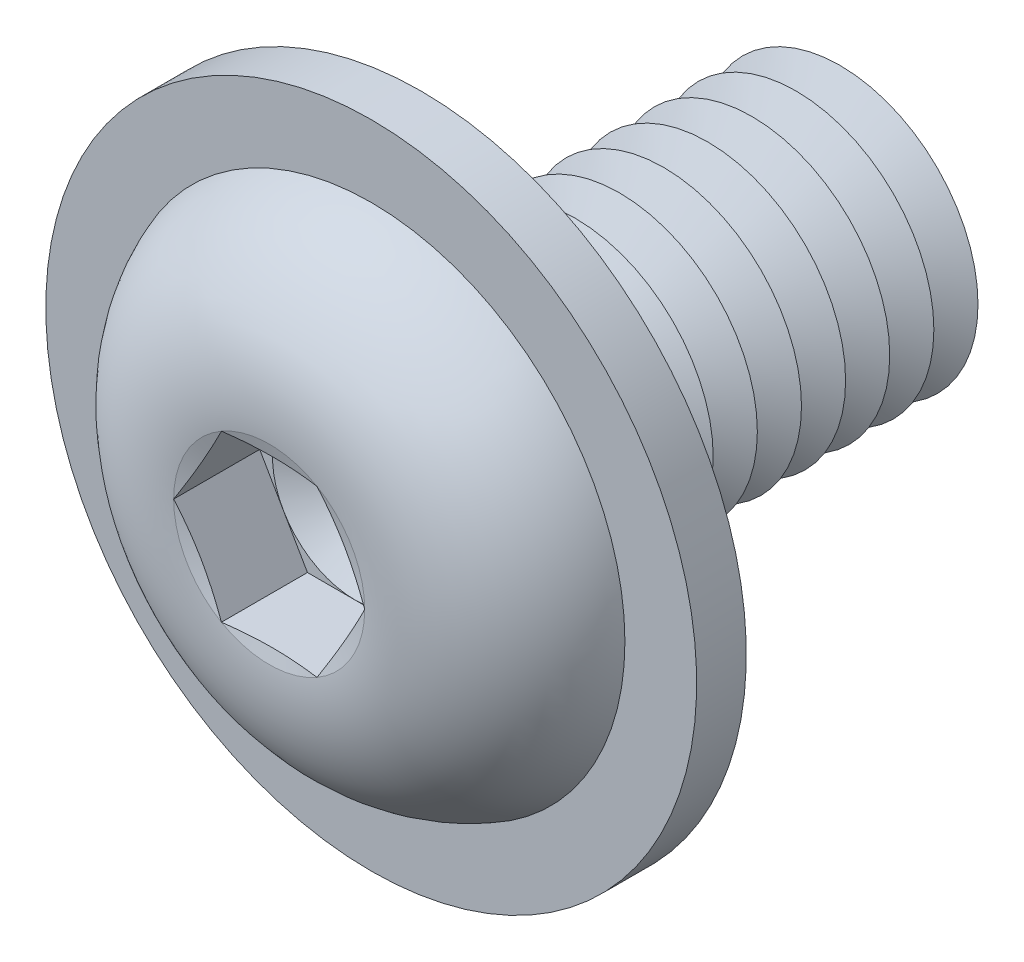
ISO-10303-21;
HEADER;
FILE_DESCRIPTION(('STEP AP214'),'2;1');
FILE_NAME('part.step','',(''),(''),'','','');
FILE_SCHEMA(('AUTOMOTIVE_DESIGN { 1 0 10303 214 1 1 1 1 }'));
ENDSEC;
DATA;
#1=APPLICATION_CONTEXT('core data for automotive mechanical design processes');
#2=APPLICATION_PROTOCOL_DEFINITION('international standard','automotive_design',2000,#1);
#3=PRODUCT_CONTEXT('',#1,'mechanical');
#4=PRODUCT('Part','Part','',(#3));
#5=PRODUCT_RELATED_PRODUCT_CATEGORY('part','',(#4));
#6=PRODUCT_DEFINITION_FORMATION('','',#4);
#7=PRODUCT_DEFINITION_CONTEXT('part definition',#1,'design');
#8=PRODUCT_DEFINITION('design','',#6,#7);
#9=PRODUCT_DEFINITION_SHAPE('','',#8);
#10=(LENGTH_UNIT() NAMED_UNIT(*) SI_UNIT(.MILLI.,.METRE.));
#11=(NAMED_UNIT(*) PLANE_ANGLE_UNIT() SI_UNIT($,.RADIAN.));
#12=(NAMED_UNIT(*) SI_UNIT($,.STERADIAN.) SOLID_ANGLE_UNIT());
#13=UNCERTAINTY_MEASURE_WITH_UNIT(LENGTH_MEASURE(1.E-05),#10,'distance_accuracy_value','');
#14=(GEOMETRIC_REPRESENTATION_CONTEXT(3) GLOBAL_UNCERTAINTY_ASSIGNED_CONTEXT((#13)) GLOBAL_UNIT_ASSIGNED_CONTEXT((#10,
#11,#12)) REPRESENTATION_CONTEXT('',''));
#15=CARTESIAN_POINT('',(0.,0.,0.));
#16=DIRECTION('',(0.,0.,1.));
#17=DIRECTION('',(1.,0.,0.));
#18=AXIS2_PLACEMENT_3D('',#15,#16,#17);
#19=CARTESIAN_POINT('',(0.,0.,-5.2));
#20=DIRECTION('',(0.,0.,1.));
#21=DIRECTION('',(1.,0.,0.));
#22=AXIS2_PLACEMENT_3D('',#19,#20,#21);
#23=CONICAL_SURFACE('',#22,2.5,1.0471975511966);
#24=CARTESIAN_POINT('',(0.,0.,-5.6));
#25=DIRECTION('',(0.,0.,1.));
#26=DIRECTION('',(1.,0.,0.));
#27=AXIS2_PLACEMENT_3D('',#24,#25,#26);
#28=CIRCLE('',#27,1.80717967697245);
#29=CARTESIAN_POINT('',(1.80717967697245,0.,-5.6));
#30=VERTEX_POINT('',#29);
#31=EDGE_CURVE('E291',#30,#30,#28,.T.);
#32=ORIENTED_EDGE('',*,*,#31,.T.);
#33=EDGE_LOOP('',(#32));
#34=FACE_BOUND('',#33,.T.);
#35=CARTESIAN_POINT('',(0.,0.,-5.2));
#36=DIRECTION('',(0.,0.,1.));
#37=DIRECTION('',(1.,0.,0.));
#38=AXIS2_PLACEMENT_3D('',#35,#36,#37);
#39=CIRCLE('',#38,2.50000000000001);
#40=CARTESIAN_POINT('',(2.50000000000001,0.,-5.2));
#41=VERTEX_POINT('',#40);
#42=EDGE_CURVE('E287',#41,#41,#39,.T.);
#43=ORIENTED_EDGE('',*,*,#42,.F.);
#44=EDGE_LOOP('',(#43));
#45=FACE_BOUND('',#44,.T.);
#46=ADVANCED_FACE('F39',(#34,#45),#23,.T.);
#47=CARTESIAN_POINT('',(0.,0.,-5.6));
#48=DIRECTION('',(0.,0.,-1.));
#49=DIRECTION('',(-1.,0.,0.));
#50=AXIS2_PLACEMENT_3D('',#47,#48,#49);
#51=CONICAL_SURFACE('',#50,1.80717967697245,1.0471975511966);
#52=CARTESIAN_POINT('',(0.,0.,-6.));
#53=DIRECTION('',(0.,0.,1.));
#54=DIRECTION('',(1.,0.,0.));
#55=AXIS2_PLACEMENT_3D('',#52,#53,#54);
#56=CIRCLE('',#55,2.50000000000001);
#57=CARTESIAN_POINT('',(2.50000000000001,0.,-6.));
#58=VERTEX_POINT('',#57);
#59=EDGE_CURVE('E295',#58,#58,#56,.T.);
#60=ORIENTED_EDGE('',*,*,#59,.T.);
#61=EDGE_LOOP('',(#60));
#62=FACE_BOUND('',#61,.T.);
#63=ORIENTED_EDGE('',*,*,#31,.F.);
#64=EDGE_LOOP('',(#63));
#65=FACE_BOUND('',#64,.T.);
#66=ADVANCED_FACE('F406',(#62,#65),#51,.T.);
#67=CARTESIAN_POINT('',(0.,2.5,-8.));
#68=DIRECTION('',(0.,0.,-1.));
#69=DIRECTION('',(-1.,0.,0.));
#70=AXIS2_PLACEMENT_3D('',#67,#68,#69);
#71=PLANE('',#70);
#72=CARTESIAN_POINT('',(0.,0.,-8.));
#73=DIRECTION('',(0.,0.,1.));
#74=DIRECTION('',(1.,0.,0.));
#75=AXIS2_PLACEMENT_3D('',#72,#73,#74);
#76=CIRCLE('',#75,1.80717967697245);
#77=CARTESIAN_POINT('',(1.80717967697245,0.,-8.));
#78=VERTEX_POINT('',#77);
#79=EDGE_CURVE('E315',#78,#78,#76,.T.);
#80=ORIENTED_EDGE('',*,*,#79,.F.);
#81=EDGE_LOOP('',(#80));
#82=FACE_BOUND('',#81,.T.);
#83=ADVANCED_FACE('F412',(#82),#71,.T.);
#84=CARTESIAN_POINT('',(0.,0.,-7.6));
#85=DIRECTION('',(0.,0.,1.));
#86=DIRECTION('',(1.,0.,0.));
#87=AXIS2_PLACEMENT_3D('',#84,#85,#86);
#88=CONICAL_SURFACE('',#87,2.5,1.0471975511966);
#89=ORIENTED_EDGE('',*,*,#79,.T.);
#90=EDGE_LOOP('',(#89));
#91=FACE_BOUND('',#90,.T.);
#92=CARTESIAN_POINT('',(0.,0.,-7.6));
#93=DIRECTION('',(0.,0.,1.));
#94=DIRECTION('',(1.,0.,0.));
#95=AXIS2_PLACEMENT_3D('',#92,#93,#94);
#96=CIRCLE('',#95,2.50000000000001);
#97=CARTESIAN_POINT('',(2.50000000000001,0.,-7.6));
#98=VERTEX_POINT('',#97);
#99=EDGE_CURVE('E311',#98,#98,#96,.T.);
#100=ORIENTED_EDGE('',*,*,#99,.F.);
#101=EDGE_LOOP('',(#100));
#102=FACE_BOUND('',#101,.T.);
#103=ADVANCED_FACE('F431',(#91,#102),#88,.T.);
#104=CARTESIAN_POINT('',(0.,0.,-7.2));
#105=DIRECTION('',(0.,0.,-1.));
#106=DIRECTION('',(-1.,0.,0.));
#107=AXIS2_PLACEMENT_3D('',#104,#105,#106);
#108=CONICAL_SURFACE('',#107,1.80717967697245,1.0471975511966);
#109=ORIENTED_EDGE('',*,*,#99,.T.);
#110=EDGE_LOOP('',(#109));
#111=FACE_BOUND('',#110,.T.);
#112=CARTESIAN_POINT('',(0.,0.,-7.2));
#113=DIRECTION('',(0.,0.,1.));
#114=DIRECTION('',(1.,0.,0.));
#115=AXIS2_PLACEMENT_3D('',#112,#113,#114);
#116=CIRCLE('',#115,1.80717967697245);
#117=CARTESIAN_POINT('',(1.80717967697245,0.,-7.2));
#118=VERTEX_POINT('',#117);
#119=EDGE_CURVE('E307',#118,#118,#116,.T.);
#120=ORIENTED_EDGE('',*,*,#119,.F.);
#121=EDGE_LOOP('',(#120));
#122=FACE_BOUND('',#121,.T.);
#123=ADVANCED_FACE('F428',(#111,#122),#108,.T.);
#124=CARTESIAN_POINT('',(0.,0.,-6.8));
#125=DIRECTION('',(0.,0.,1.));
#126=DIRECTION('',(1.,0.,0.));
#127=AXIS2_PLACEMENT_3D('',#124,#125,#126);
#128=CONICAL_SURFACE('',#127,2.5,1.0471975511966);
#129=ORIENTED_EDGE('',*,*,#119,.T.);
#130=EDGE_LOOP('',(#129));
#131=FACE_BOUND('',#130,.T.);
#132=CARTESIAN_POINT('',(0.,0.,-6.8));
#133=DIRECTION('',(0.,0.,1.));
#134=DIRECTION('',(1.,0.,0.));
#135=AXIS2_PLACEMENT_3D('',#132,#133,#134);
#136=CIRCLE('',#135,2.50000000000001);
#137=CARTESIAN_POINT('',(2.50000000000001,0.,-6.8));
#138=VERTEX_POINT('',#137);
#139=EDGE_CURVE('E303',#138,#138,#136,.T.);
#140=ORIENTED_EDGE('',*,*,#139,.F.);
#141=EDGE_LOOP('',(#140));
#142=FACE_BOUND('',#141,.T.);
#143=ADVANCED_FACE('F422',(#131,#142),#128,.T.);
#144=CARTESIAN_POINT('',(0.,0.,-6.4));
#145=DIRECTION('',(0.,0.,-1.));
#146=DIRECTION('',(-1.,0.,0.));
#147=AXIS2_PLACEMENT_3D('',#144,#145,#146);
#148=CONICAL_SURFACE('',#147,1.80717967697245,1.0471975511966);
#149=ORIENTED_EDGE('',*,*,#139,.T.);
#150=EDGE_LOOP('',(#149));
#151=FACE_BOUND('',#150,.T.);
#152=CARTESIAN_POINT('',(0.,0.,-6.4));
#153=DIRECTION('',(0.,0.,1.));
#154=DIRECTION('',(1.,0.,0.));
#155=AXIS2_PLACEMENT_3D('',#152,#153,#154);
#156=CIRCLE('',#155,1.80717967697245);
#157=CARTESIAN_POINT('',(1.80717967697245,0.,-6.4));
#158=VERTEX_POINT('',#157);
#159=EDGE_CURVE('E299',#158,#158,#156,.T.);
#160=ORIENTED_EDGE('',*,*,#159,.F.);
#161=EDGE_LOOP('',(#160));
#162=FACE_BOUND('',#161,.T.);
#163=ADVANCED_FACE('F418',(#151,#162),#148,.T.);
#164=CARTESIAN_POINT('',(0.,0.,-6.));
#165=DIRECTION('',(0.,0.,1.));
#166=DIRECTION('',(1.,0.,0.));
#167=AXIS2_PLACEMENT_3D('',#164,#165,#166);
#168=CONICAL_SURFACE('',#167,2.5,1.0471975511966);
#169=ORIENTED_EDGE('',*,*,#159,.T.);
#170=EDGE_LOOP('',(#169));
#171=FACE_BOUND('',#170,.T.);
#172=ORIENTED_EDGE('',*,*,#59,.F.);
#173=EDGE_LOOP('',(#172));
#174=FACE_BOUND('',#173,.T.);
#175=ADVANCED_FACE('F421',(#171,#174),#168,.T.);
#176=CARTESIAN_POINT('',(0.,0.,-4.4));
#177=DIRECTION('',(0.,0.,1.));
#178=DIRECTION('',(1.,0.,0.));
#179=AXIS2_PLACEMENT_3D('',#176,#177,#178);
#180=CONICAL_SURFACE('',#179,2.5,1.0471975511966);
#181=CARTESIAN_POINT('',(0.,0.,-4.8));
#182=DIRECTION('',(0.,0.,1.));
#183=DIRECTION('',(1.,0.,0.));
#184=AXIS2_PLACEMENT_3D('',#181,#182,#183);
#185=CIRCLE('',#184,1.80717967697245);
#186=CARTESIAN_POINT('',(1.80717967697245,0.,-4.8));
#187=VERTEX_POINT('',#186);
#188=EDGE_CURVE('E283',#187,#187,#185,.T.);
#189=ORIENTED_EDGE('',*,*,#188,.T.);
#190=EDGE_LOOP('',(#189));
#191=FACE_BOUND('',#190,.T.);
#192=CARTESIAN_POINT('',(0.,0.,-4.4));
#193=DIRECTION('',(0.,0.,1.));
#194=DIRECTION('',(1.,0.,0.));
#195=AXIS2_PLACEMENT_3D('',#192,#193,#194);
#196=CIRCLE('',#195,2.50000000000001);
#197=CARTESIAN_POINT('',(2.50000000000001,0.,-4.4));
#198=VERTEX_POINT('',#197);
#199=EDGE_CURVE('E279',#198,#198,#196,.T.);
#200=ORIENTED_EDGE('',*,*,#199,.F.);
#201=EDGE_LOOP('',(#200));
#202=FACE_BOUND('',#201,.T.);
#203=ADVANCED_FACE('F426',(#191,#202),#180,.T.);
#204=CARTESIAN_POINT('',(0.,0.,-4.8));
#205=DIRECTION('',(0.,0.,-1.));
#206=DIRECTION('',(-1.,0.,0.));
#207=AXIS2_PLACEMENT_3D('',#204,#205,#206);
#208=CONICAL_SURFACE('',#207,1.80717967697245,1.0471975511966);
#209=ORIENTED_EDGE('',*,*,#42,.T.);
#210=EDGE_LOOP('',(#209));
#211=FACE_BOUND('',#210,.T.);
#212=ORIENTED_EDGE('',*,*,#188,.F.);
#213=EDGE_LOOP('',(#212));
#214=FACE_BOUND('',#213,.T.);
#215=ADVANCED_FACE('F477',(#211,#214),#208,.T.);
#216=CARTESIAN_POINT('',(0.,0.,-3.6));
#217=DIRECTION('',(0.,0.,1.));
#218=DIRECTION('',(1.,0.,0.));
#219=AXIS2_PLACEMENT_3D('',#216,#217,#218);
#220=CONICAL_SURFACE('',#219,2.5,1.0471975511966);
#221=CARTESIAN_POINT('',(0.,0.,-4.));
#222=DIRECTION('',(0.,0.,1.));
#223=DIRECTION('',(1.,0.,0.));
#224=AXIS2_PLACEMENT_3D('',#221,#222,#223);
#225=CIRCLE('',#224,1.80717967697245);
#226=CARTESIAN_POINT('',(1.80717967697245,0.,-4.));
#227=VERTEX_POINT('',#226);
#228=EDGE_CURVE('E275',#227,#227,#225,.T.);
#229=ORIENTED_EDGE('',*,*,#228,.T.);
#230=EDGE_LOOP('',(#229));
#231=FACE_BOUND('',#230,.T.);
#232=CARTESIAN_POINT('',(0.,0.,-3.6));
#233=DIRECTION('',(0.,0.,1.));
#234=DIRECTION('',(1.,0.,0.));
#235=AXIS2_PLACEMENT_3D('',#232,#233,#234);
#236=CIRCLE('',#235,2.50000000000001);
#237=CARTESIAN_POINT('',(2.50000000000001,0.,-3.6));
#238=VERTEX_POINT('',#237);
#239=EDGE_CURVE('E271',#238,#238,#236,.T.);
#240=ORIENTED_EDGE('',*,*,#239,.F.);
#241=EDGE_LOOP('',(#240));
#242=FACE_BOUND('',#241,.T.);
#243=ADVANCED_FACE('F483',(#231,#242),#220,.T.);
#244=CARTESIAN_POINT('',(0.,0.,-4.));
#245=DIRECTION('',(0.,0.,-1.));
#246=DIRECTION('',(-1.,0.,0.));
#247=AXIS2_PLACEMENT_3D('',#244,#245,#246);
#248=CONICAL_SURFACE('',#247,1.80717967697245,1.0471975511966);
#249=ORIENTED_EDGE('',*,*,#199,.T.);
#250=EDGE_LOOP('',(#249));
#251=FACE_BOUND('',#250,.T.);
#252=ORIENTED_EDGE('',*,*,#228,.F.);
#253=EDGE_LOOP('',(#252));
#254=FACE_BOUND('',#253,.T.);
#255=ADVANCED_FACE('F490',(#251,#254),#248,.T.);
#256=CARTESIAN_POINT('',(0.,0.,-2.8));
#257=DIRECTION('',(0.,0.,1.));
#258=DIRECTION('',(1.,0.,0.));
#259=AXIS2_PLACEMENT_3D('',#256,#257,#258);
#260=CONICAL_SURFACE('',#259,2.5,1.0471975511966);
#261=CARTESIAN_POINT('',(0.,0.,-3.2));
#262=DIRECTION('',(0.,0.,1.));
#263=DIRECTION('',(1.,0.,0.));
#264=AXIS2_PLACEMENT_3D('',#261,#262,#263);
#265=CIRCLE('',#264,1.80717967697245);
#266=CARTESIAN_POINT('',(1.80717967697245,0.,-3.2));
#267=VERTEX_POINT('',#266);
#268=EDGE_CURVE('E267',#267,#267,#265,.T.);
#269=ORIENTED_EDGE('',*,*,#268,.T.);
#270=EDGE_LOOP('',(#269));
#271=FACE_BOUND('',#270,.T.);
#272=CARTESIAN_POINT('',(0.,0.,-2.8));
#273=DIRECTION('',(0.,0.,1.));
#274=DIRECTION('',(1.,0.,0.));
#275=AXIS2_PLACEMENT_3D('',#272,#273,#274);
#276=CIRCLE('',#275,2.50000000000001);
#277=CARTESIAN_POINT('',(2.50000000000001,0.,-2.8));
#278=VERTEX_POINT('',#277);
#279=EDGE_CURVE('E263',#278,#278,#276,.T.);
#280=ORIENTED_EDGE('',*,*,#279,.F.);
#281=EDGE_LOOP('',(#280));
#282=FACE_BOUND('',#281,.T.);
#283=ADVANCED_FACE('F497',(#271,#282),#260,.T.);
#284=CARTESIAN_POINT('',(0.,0.,-3.2));
#285=DIRECTION('',(0.,0.,-1.));
#286=DIRECTION('',(-1.,0.,0.));
#287=AXIS2_PLACEMENT_3D('',#284,#285,#286);
#288=CONICAL_SURFACE('',#287,1.80717967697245,1.0471975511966);
#289=ORIENTED_EDGE('',*,*,#239,.T.);
#290=EDGE_LOOP('',(#289));
#291=FACE_BOUND('',#290,.T.);
#292=ORIENTED_EDGE('',*,*,#268,.F.);
#293=EDGE_LOOP('',(#292));
#294=FACE_BOUND('',#293,.T.);
#295=ADVANCED_FACE('F504',(#291,#294),#288,.T.);
#296=CARTESIAN_POINT('',(0.,0.,-2.));
#297=DIRECTION('',(0.,0.,1.));
#298=DIRECTION('',(1.,0.,0.));
#299=AXIS2_PLACEMENT_3D('',#296,#297,#298);
#300=CONICAL_SURFACE('',#299,2.5,1.0471975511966);
#301=CARTESIAN_POINT('',(0.,0.,-2.4));
#302=DIRECTION('',(0.,0.,1.));
#303=DIRECTION('',(1.,0.,0.));
#304=AXIS2_PLACEMENT_3D('',#301,#302,#303);
#305=CIRCLE('',#304,1.80717967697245);
#306=CARTESIAN_POINT('',(1.80717967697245,0.,-2.4));
#307=VERTEX_POINT('',#306);
#308=EDGE_CURVE('E259',#307,#307,#305,.T.);
#309=ORIENTED_EDGE('',*,*,#308,.T.);
#310=EDGE_LOOP('',(#309));
#311=FACE_BOUND('',#310,.T.);
#312=CARTESIAN_POINT('',(0.,0.,-2.));
#313=DIRECTION('',(0.,0.,1.));
#314=DIRECTION('',(1.,0.,0.));
#315=AXIS2_PLACEMENT_3D('',#312,#313,#314);
#316=CIRCLE('',#315,2.50000000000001);
#317=CARTESIAN_POINT('',(2.50000000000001,0.,-2.));
#318=VERTEX_POINT('',#317);
#319=EDGE_CURVE('E255',#318,#318,#316,.T.);
#320=ORIENTED_EDGE('',*,*,#319,.F.);
#321=EDGE_LOOP('',(#320));
#322=FACE_BOUND('',#321,.T.);
#323=ADVANCED_FACE('F511',(#311,#322),#300,.T.);
#324=CARTESIAN_POINT('',(0.,0.,-2.4));
#325=DIRECTION('',(0.,0.,-1.));
#326=DIRECTION('',(-1.,0.,0.));
#327=AXIS2_PLACEMENT_3D('',#324,#325,#326);
#328=CONICAL_SURFACE('',#327,1.80717967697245,1.0471975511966);
#329=ORIENTED_EDGE('',*,*,#279,.T.);
#330=EDGE_LOOP('',(#329));
#331=FACE_BOUND('',#330,.T.);
#332=ORIENTED_EDGE('',*,*,#308,.F.);
#333=EDGE_LOOP('',(#332));
#334=FACE_BOUND('',#333,.T.);
#335=ADVANCED_FACE('F518',(#331,#334),#328,.T.);
#336=CARTESIAN_POINT('',(0.,0.,-1.2));
#337=DIRECTION('',(0.,0.,1.));
#338=DIRECTION('',(1.,0.,0.));
#339=AXIS2_PLACEMENT_3D('',#336,#337,#338);
#340=CONICAL_SURFACE('',#339,2.5,1.0471975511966);
#341=CARTESIAN_POINT('',(0.,0.,-1.6));
#342=DIRECTION('',(0.,0.,1.));
#343=DIRECTION('',(1.,0.,0.));
#344=AXIS2_PLACEMENT_3D('',#341,#342,#343);
#345=CIRCLE('',#344,1.80717967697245);
#346=CARTESIAN_POINT('',(1.80717967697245,0.,-1.6));
#347=VERTEX_POINT('',#346);
#348=EDGE_CURVE('E251',#347,#347,#345,.T.);
#349=ORIENTED_EDGE('',*,*,#348,.T.);
#350=EDGE_LOOP('',(#349));
#351=FACE_BOUND('',#350,.T.);
#352=CARTESIAN_POINT('',(0.,0.,-1.2));
#353=DIRECTION('',(0.,0.,1.));
#354=DIRECTION('',(1.,0.,0.));
#355=AXIS2_PLACEMENT_3D('',#352,#353,#354);
#356=CIRCLE('',#355,2.50000000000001);
#357=CARTESIAN_POINT('',(2.50000000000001,0.,-1.2));
#358=VERTEX_POINT('',#357);
#359=EDGE_CURVE('E243',#358,#358,#356,.T.);
#360=ORIENTED_EDGE('',*,*,#359,.F.);
#361=EDGE_LOOP('',(#360));
#362=FACE_BOUND('',#361,.T.);
#363=ADVANCED_FACE('F525',(#351,#362),#340,.T.);
#364=CARTESIAN_POINT('',(0.,0.,-1.6));
#365=DIRECTION('',(0.,0.,-1.));
#366=DIRECTION('',(-1.,0.,0.));
#367=AXIS2_PLACEMENT_3D('',#364,#365,#366);
#368=CONICAL_SURFACE('',#367,1.80717967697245,1.0471975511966);
#369=ORIENTED_EDGE('',*,*,#319,.T.);
#370=EDGE_LOOP('',(#369));
#371=FACE_BOUND('',#370,.T.);
#372=ORIENTED_EDGE('',*,*,#348,.F.);
#373=EDGE_LOOP('',(#372));
#374=FACE_BOUND('',#373,.T.);
#375=ADVANCED_FACE('F532',(#371,#374),#368,.T.);
#376=CARTESIAN_POINT('',(0.,0.,-0.399999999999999));
#377=DIRECTION('',(0.,0.,1.));
#378=DIRECTION('',(1.,0.,0.));
#379=AXIS2_PLACEMENT_3D('',#376,#377,#378);
#380=CONICAL_SURFACE('',#379,2.5,1.0471975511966);
#381=CARTESIAN_POINT('',(0.,0.,-0.799999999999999));
#382=DIRECTION('',(0.,0.,1.));
#383=DIRECTION('',(1.,0.,0.));
#384=AXIS2_PLACEMENT_3D('',#381,#382,#383);
#385=CIRCLE('',#384,1.80717967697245);
#386=CARTESIAN_POINT('',(1.80717967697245,0.,-0.799999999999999));
#387=VERTEX_POINT('',#386);
#388=EDGE_CURVE('E232',#387,#387,#385,.T.);
#389=ORIENTED_EDGE('',*,*,#388,.T.);
#390=EDGE_LOOP('',(#389));
#391=FACE_BOUND('',#390,.T.);
#392=CARTESIAN_POINT('',(0.,0.,-0.399999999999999));
#393=DIRECTION('',(0.,0.,1.));
#394=DIRECTION('',(1.,0.,0.));
#395=AXIS2_PLACEMENT_3D('',#392,#393,#394);
#396=CIRCLE('',#395,2.5);
#397=CARTESIAN_POINT('',(2.5,0.,-0.399999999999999));
#398=VERTEX_POINT('',#397);
#399=EDGE_CURVE('E247',#398,#398,#396,.T.);
#400=ORIENTED_EDGE('',*,*,#399,.F.);
#401=EDGE_LOOP('',(#400));
#402=FACE_BOUND('',#401,.T.);
#403=ADVANCED_FACE('F539',(#391,#402),#380,.T.);
#404=CARTESIAN_POINT('',(0.,0.,-0.799999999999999));
#405=DIRECTION('',(0.,0.,-1.));
#406=DIRECTION('',(-1.,0.,0.));
#407=AXIS2_PLACEMENT_3D('',#404,#405,#406);
#408=CONICAL_SURFACE('',#407,1.80717967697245,1.0471975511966);
#409=ORIENTED_EDGE('',*,*,#359,.T.);
#410=EDGE_LOOP('',(#409));
#411=FACE_BOUND('',#410,.T.);
#412=ORIENTED_EDGE('',*,*,#388,.F.);
#413=EDGE_LOOP('',(#412));
#414=FACE_BOUND('',#413,.T.);
#415=ADVANCED_FACE('F221',(#411,#414),#408,.T.);
#416=CARTESIAN_POINT('',(0.,2.5,0.));
#417=DIRECTION('',(0.,0.,-1.));
#418=DIRECTION('',(-1.,0.,0.));
#419=AXIS2_PLACEMENT_3D('',#416,#417,#418);
#420=PLANE('',#419);
#421=CARTESIAN_POINT('',(0.,0.,0.));
#422=DIRECTION('',(0.,0.,-1.));
#423=DIRECTION('',(-1.,0.,0.));
#424=AXIS2_PLACEMENT_3D('',#421,#422,#423);
#425=CIRCLE('',#424,2.9);
#426=CARTESIAN_POINT('',(-2.9,0.,0.));
#427=VERTEX_POINT('',#426);
#428=EDGE_CURVE('E324',#427,#427,#425,.F.);
#429=ORIENTED_EDGE('',*,*,#428,.T.);
#430=EDGE_LOOP('',(#429));
#431=FACE_BOUND('',#430,.T.);
#432=CARTESIAN_POINT('',(0.,0.,0.));
#433=DIRECTION('',(0.,0.,-1.));
#434=DIRECTION('',(0.,1.,0.));
#435=AXIS2_PLACEMENT_3D('',#432,#433,#434);
#436=CIRCLE('',#435,5.9);
#437=CARTESIAN_POINT('',(0.,5.9,0.));
#438=VERTEX_POINT('',#437);
#439=EDGE_CURVE('E384',#438,#438,#436,.T.);
#440=ORIENTED_EDGE('',*,*,#439,.T.);
#441=EDGE_LOOP('',(#440));
#442=FACE_BOUND('',#441,.T.);
#443=ADVANCED_FACE('F551',(#431,#442),#420,.T.);
#444=CARTESIAN_POINT('',(0.,0.,-0.399999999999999));
#445=DIRECTION('',(0.,0.,-1.));
#446=DIRECTION('',(-1.,0.,0.));
#447=AXIS2_PLACEMENT_3D('',#444,#445,#446);
#448=TOROIDAL_SURFACE('',#447,2.9,0.4);
#449=ORIENTED_EDGE('',*,*,#428,.F.);
#450=EDGE_LOOP('',(#449));
#451=FACE_BOUND('',#450,.T.);
#452=ORIENTED_EDGE('',*,*,#399,.T.);
#453=EDGE_LOOP('',(#452));
#454=FACE_BOUND('',#453,.T.);
#455=ADVANCED_FACE('F41',(#451,#454),#448,.F.);
#456=CARTESIAN_POINT('',(0.,0.,0.9));
#457=DIRECTION('',(0.,0.,-1.));
#458=DIRECTION('',(0.,1.,0.));
#459=AXIS2_PLACEMENT_3D('',#456,#457,#458);
#460=CYLINDRICAL_SURFACE('',#459,5.9);
#461=CARTESIAN_POINT('',(0.,0.,0.9));
#462=DIRECTION('',(0.,0.,-1.));
#463=DIRECTION('',(0.,1.,0.));
#464=AXIS2_PLACEMENT_3D('',#461,#462,#463);
#465=CIRCLE('',#464,5.9);
#466=CARTESIAN_POINT('',(0.,5.9,0.9));
#467=VERTEX_POINT('',#466);
#468=EDGE_CURVE('E386',#467,#467,#465,.T.);
#469=ORIENTED_EDGE('',*,*,#468,.T.);
#470=EDGE_LOOP('',(#469));
#471=FACE_BOUND('',#470,.T.);
#472=ORIENTED_EDGE('',*,*,#439,.F.);
#473=EDGE_LOOP('',(#472));
#474=FACE_BOUND('',#473,.T.);
#475=ADVANCED_FACE('F399',(#471,#474),#460,.T.);
#476=CARTESIAN_POINT('',(0.,0.,0.9));
#477=DIRECTION('',(0.,0.,-1.));
#478=DIRECTION('',(0.,1.,0.));
#479=AXIS2_PLACEMENT_3D('',#476,#477,#478);
#480=PLANE('',#479);
#481=CARTESIAN_POINT('',(0.,0.,0.9));
#482=DIRECTION('',(0.,0.,-1.));
#483=DIRECTION('',(0.,1.,0.));
#484=AXIS2_PLACEMENT_3D('',#481,#482,#483);
#485=CIRCLE('',#484,4.59924727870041);
#486=CARTESIAN_POINT('',(0.,4.59924727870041,0.9));
#487=VERTEX_POINT('',#486);
#488=EDGE_CURVE('E43',#487,#487,#485,.F.);
#489=ORIENTED_EDGE('',*,*,#488,.F.);
#490=EDGE_LOOP('',(#489));
#491=FACE_BOUND('',#490,.T.);
#492=ORIENTED_EDGE('',*,*,#468,.F.);
#493=EDGE_LOOP('',(#492));
#494=FACE_BOUND('',#493,.T.);
#495=ADVANCED_FACE('F117',(#491,#494),#480,.F.);
#496=CARTESIAN_POINT('',(0.,0.,1.19));
#497=DIRECTION('',(0.,0.,1.));
#498=DIRECTION('',(1.,0.,0.));
#499=AXIS2_PLACEMENT_3D('',#496,#497,#498);
#500=CONICAL_SURFACE('',#499,1.49999930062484,1.0471975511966);
#501=CARTESIAN_POINT('',(0.,0.,0.323975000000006));
#502=VERTEX_POINT('',#501);
#503=VERTEX_LOOP('',#502);
#504=FACE_BOUND('',#503,.T.);
#505=CARTESIAN_POINT('',(0.,0.,1.19));
#506=DIRECTION('',(0.,0.,1.));
#507=DIRECTION('',(1.,0.,0.));
#508=AXIS2_PLACEMENT_3D('',#505,#506,#507);
#509=CIRCLE('',#508,1.49999930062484);
#510=CARTESIAN_POINT('',(1.2990375,0.749999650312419,1.19));
#511=VERTEX_POINT('',#510);
#512=CARTESIAN_POINT('',(0.,1.49999930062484,1.19));
#513=VERTEX_POINT('',#512);
#514=EDGE_CURVE('E120',#511,#513,#509,.T.);
#515=ORIENTED_EDGE('',*,*,#514,.T.);
#516=CARTESIAN_POINT('',(0.,0.,1.19));
#517=DIRECTION('',(0.,0.,1.));
#518=DIRECTION('',(1.,0.,0.));
#519=AXIS2_PLACEMENT_3D('',#516,#517,#518);
#520=CIRCLE('',#519,1.49999930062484);
#521=CARTESIAN_POINT('',(-1.2990375,0.749999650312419,1.19));
#522=VERTEX_POINT('',#521);
#523=EDGE_CURVE('E11',#513,#522,#520,.T.);
#524=ORIENTED_EDGE('',*,*,#523,.T.);
#525=CARTESIAN_POINT('',(-1.2990375,-0.749999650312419,1.19));
#526=VERTEX_POINT('',#525);
#527=EDGE_CURVE('E49',#522,#526,#520,.T.);
#528=ORIENTED_EDGE('',*,*,#527,.T.);
#529=CARTESIAN_POINT('',(0.,-1.49999930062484,1.19));
#530=VERTEX_POINT('',#529);
#531=EDGE_CURVE('E330',#526,#530,#520,.T.);
#532=ORIENTED_EDGE('',*,*,#531,.T.);
#533=CARTESIAN_POINT('',(1.2990375,-0.749999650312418,1.19));
#534=VERTEX_POINT('',#533);
#535=EDGE_CURVE('E57',#530,#534,#520,.T.);
#536=ORIENTED_EDGE('',*,*,#535,.T.);
#537=EDGE_CURVE('E50',#534,#511,#520,.T.);
#538=ORIENTED_EDGE('',*,*,#537,.T.);
#539=EDGE_LOOP('',(#515,#524,#528,#532,#536,#538));
#540=FACE_BOUND('',#539,.T.);
#541=ADVANCED_FACE('F114',(#504,#540),#500,.F.);
#542=CARTESIAN_POINT('',(0.,0.,1.19));
#543=DIRECTION('',(0.,0.,1.));
#544=DIRECTION('',(1.,0.,0.));
#545=AXIS2_PLACEMENT_3D('',#542,#543,#544);
#546=PLANE('',#545);
#547=ORIENTED_EDGE('',*,*,#531,.F.);
#548=DIRECTION('',(0.5,-0.866025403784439,0.));
#549=VECTOR('',#548,1.);
#550=CARTESIAN_POINT('',(-1.73205,0.,1.19));
#551=LINE('',#550,#549);
#552=CARTESIAN_POINT('',(-0.866025,-1.49999930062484,1.19));
#553=VERTEX_POINT('',#552);
#554=EDGE_CURVE('E154',#526,#553,#551,.T.);
#555=ORIENTED_EDGE('',*,*,#554,.T.);
#556=DIRECTION('',(1.,0.,0.));
#557=VECTOR('',#556,1.);
#558=CARTESIAN_POINT('',(-0.866025,-1.49999930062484,1.19));
#559=LINE('',#558,#557);
#560=EDGE_CURVE('E160',#553,#530,#559,.T.);
#561=ORIENTED_EDGE('',*,*,#560,.T.);
#562=EDGE_LOOP('',(#547,#555,#561));
#563=FACE_BOUND('',#562,.T.);
#564=ADVANCED_FACE('F116',(#563),#546,.T.);
#565=ORIENTED_EDGE('',*,*,#535,.F.);
#566=CARTESIAN_POINT('',(0.866024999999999,-1.49999930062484,1.19));
#567=VERTEX_POINT('',#566);
#568=EDGE_CURVE('E159',#530,#567,#559,.T.);
#569=ORIENTED_EDGE('',*,*,#568,.T.);
#570=DIRECTION('',(0.5,0.866025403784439,0.));
#571=VECTOR('',#570,1.);
#572=CARTESIAN_POINT('',(0.866024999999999,-1.49999930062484,1.19));
#573=LINE('',#572,#571);
#574=EDGE_CURVE('E165',#567,#534,#573,.T.);
#575=ORIENTED_EDGE('',*,*,#574,.T.);
#576=EDGE_LOOP('',(#565,#569,#575));
#577=FACE_BOUND('',#576,.T.);
#578=ADVANCED_FACE('F582',(#577),#546,.T.);
#579=ORIENTED_EDGE('',*,*,#537,.F.);
#580=CARTESIAN_POINT('',(1.73205,0.,1.19));
#581=VERTEX_POINT('',#580);
#582=EDGE_CURVE('E164',#534,#581,#573,.T.);
#583=ORIENTED_EDGE('',*,*,#582,.T.);
#584=DIRECTION('',(-0.5,0.866025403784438,0.));
#585=VECTOR('',#584,1.);
#586=CARTESIAN_POINT('',(1.73205,0.,1.19));
#587=LINE('',#586,#585);
#588=EDGE_CURVE('E142',#581,#511,#587,.T.);
#589=ORIENTED_EDGE('',*,*,#588,.T.);
#590=EDGE_LOOP('',(#579,#583,#589));
#591=FACE_BOUND('',#590,.T.);
#592=ADVANCED_FACE('F591',(#591),#546,.T.);
#593=ORIENTED_EDGE('',*,*,#514,.F.);
#594=CARTESIAN_POINT('',(0.866025,1.49999930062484,1.19));
#595=VERTEX_POINT('',#594);
#596=EDGE_CURVE('E127',#511,#595,#587,.T.);
#597=ORIENTED_EDGE('',*,*,#596,.T.);
#598=DIRECTION('',(-1.,0.,0.));
#599=VECTOR('',#598,1.);
#600=CARTESIAN_POINT('',(0.866025,1.49999930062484,1.19));
#601=LINE('',#600,#599);
#602=EDGE_CURVE('E138',#595,#513,#601,.T.);
#603=ORIENTED_EDGE('',*,*,#602,.T.);
#604=EDGE_LOOP('',(#593,#597,#603));
#605=FACE_BOUND('',#604,.T.);
#606=ADVANCED_FACE('F144',(#605),#546,.T.);
#607=ORIENTED_EDGE('',*,*,#523,.F.);
#608=CARTESIAN_POINT('',(-0.866025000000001,1.49999930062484,1.19));
#609=VERTEX_POINT('',#608);
#610=EDGE_CURVE('E133',#513,#609,#601,.T.);
#611=ORIENTED_EDGE('',*,*,#610,.T.);
#612=DIRECTION('',(-0.5,-0.866025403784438,0.));
#613=VECTOR('',#612,1.);
#614=CARTESIAN_POINT('',(-0.866025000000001,1.49999930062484,1.19));
#615=LINE('',#614,#613);
#616=EDGE_CURVE('E136',#609,#522,#615,.T.);
#617=ORIENTED_EDGE('',*,*,#616,.T.);
#618=EDGE_LOOP('',(#607,#611,#617));
#619=FACE_BOUND('',#618,.T.);
#620=ADVANCED_FACE('F132',(#619),#546,.T.);
#621=ORIENTED_EDGE('',*,*,#527,.F.);
#622=CARTESIAN_POINT('',(-1.73205,0.,1.19));
#623=VERTEX_POINT('',#622);
#624=EDGE_CURVE('E146',#522,#623,#615,.T.);
#625=ORIENTED_EDGE('',*,*,#624,.T.);
#626=EDGE_CURVE('E155',#623,#526,#551,.T.);
#627=ORIENTED_EDGE('',*,*,#626,.T.);
#628=EDGE_LOOP('',(#621,#625,#627));
#629=FACE_BOUND('',#628,.T.);
#630=ADVANCED_FACE('F346',(#629),#546,.T.);
#631=CARTESIAN_POINT('',(-1.73205,0.,1.19));
#632=DIRECTION('',(-0.866025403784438,-0.5,0.));
#633=DIRECTION('',(0.5,-0.866025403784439,0.));
#634=AXIS2_PLACEMENT_3D('',#631,#632,#633);
#635=PLANE('',#634);
#636=CARTESIAN_POINT('',(-1.73216547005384,0.000200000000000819,2.75003094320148));
#637=CARTESIAN_POINT('',(-1.69619207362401,-0.0621077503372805,2.74038633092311));
#638=CARTESIAN_POINT('',(-1.66015343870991,-0.124528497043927,2.73163050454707));
#639=CARTESIAN_POINT('',(-1.58794885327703,-0.249590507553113,2.71624720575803));
#640=CARTESIAN_POINT('',(-1.55178285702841,-0.312231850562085,2.70962059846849));
#641=CARTESIAN_POINT('',(-1.47954289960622,-0.437355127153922,2.69888271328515));
#642=CARTESIAN_POINT('',(-1.4434694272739,-0.499836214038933,2.69475862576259));
#643=CARTESIAN_POINT('',(-1.37127646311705,-0.624878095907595,2.68922863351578));
#644=CARTESIAN_POINT('',(-1.33515698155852,-0.687438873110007,2.68782220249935));
#645=CARTESIAN_POINT('',(-1.26291801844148,-0.812560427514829,2.68782220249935));
#646=CARTESIAN_POINT('',(-1.22679853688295,-0.87512120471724,2.68922863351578));
#647=CARTESIAN_POINT('',(-1.1546055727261,-1.0001630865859,2.69475862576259));
#648=CARTESIAN_POINT('',(-1.11853210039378,-1.06264417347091,2.69888271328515));
#649=CARTESIAN_POINT('',(-1.0462921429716,-1.18776745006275,2.70962059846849));
#650=CARTESIAN_POINT('',(-1.01012614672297,-1.25040879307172,2.71624720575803));
#651=CARTESIAN_POINT('',(-0.937921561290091,-1.37547080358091,2.73163050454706));
#652=CARTESIAN_POINT('',(-0.901882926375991,-1.43789155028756,2.74038633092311));
#653=CARTESIAN_POINT('',(-0.865909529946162,-1.50019930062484,2.75003094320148));
#654=B_SPLINE_CURVE_WITH_KNOTS('',3,(#636,#637,#638,#639,#640,#641,#642,#643,#644,#645,#646,
#647,#648,#649,#650,#651,#652,#653),.UNSPECIFIED.,.F.,.F.,(4,2,2,2,2,2,2,2,4),(0.,
0.217782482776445,0.435653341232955,0.652399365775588,0.869103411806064,1.08580745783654,
1.30255348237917,1.52042434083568,1.73820682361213),.UNSPECIFIED.);
#655=CARTESIAN_POINT('',(-1.73205,0.,2.75));
#656=VERTEX_POINT('',#655);
#657=CARTESIAN_POINT('',(-0.866025,-1.49999930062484,2.75));
#658=VERTEX_POINT('',#657);
#659=EDGE_CURVE('E351',#656,#658,#654,.T.);
#660=ORIENTED_EDGE('',*,*,#659,.T.);
#661=DIRECTION('',(0.,0.,1.));
#662=VECTOR('',#661,1.);
#663=CARTESIAN_POINT('',(-0.866025,-1.49999930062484,1.19));
#664=LINE('',#663,#662);
#665=EDGE_CURVE('E178',#553,#658,#664,.T.);
#666=ORIENTED_EDGE('',*,*,#665,.F.);
#667=ORIENTED_EDGE('',*,*,#554,.F.);
#668=ORIENTED_EDGE('',*,*,#626,.F.);
#669=DIRECTION('',(0.,0.,1.));
#670=VECTOR('',#669,1.);
#671=CARTESIAN_POINT('',(-1.73205,0.,1.19));
#672=LINE('',#671,#670);
#673=EDGE_CURVE('E182',#623,#656,#672,.T.);
#674=ORIENTED_EDGE('',*,*,#673,.T.);
#675=EDGE_LOOP('',(#660,#666,#667,#668,#674));
#676=FACE_BOUND('',#675,.T.);
#677=ADVANCED_FACE('F344',(#676),#635,.F.);
#678=CARTESIAN_POINT('',(-0.866025,-1.49999930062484,1.19));
#679=DIRECTION('',(0.,-1.,0.));
#680=DIRECTION('',(0.,0.,-1.));
#681=AXIS2_PLACEMENT_3D('',#678,#679,#680);
#682=PLANE('',#681);
#683=CARTESIAN_POINT('',(-2.61375031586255,-1.49999930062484,3.09338600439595));
#684=CARTESIAN_POINT('',(-2.48719895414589,-1.49999930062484,3.06401688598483));
#685=CARTESIAN_POINT('',(-2.36054180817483,-1.49999930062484,3.03507426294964));
#686=CARTESIAN_POINT('',(-2.10688190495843,-1.49999930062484,2.97862489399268));
#687=CARTESIAN_POINT('',(-1.97987908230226,-1.49999930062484,2.95111844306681));
#688=CARTESIAN_POINT('',(-1.72425281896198,-1.49999930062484,2.89788845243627));
#689=CARTESIAN_POINT('',(-1.59562534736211,-1.49999930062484,2.87218404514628));
#690=CARTESIAN_POINT('',(-1.33776732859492,-1.49999930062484,2.82387586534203));
#691=CARTESIAN_POINT('',(-1.20853672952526,-1.49999930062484,2.80127236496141));
#692=CARTESIAN_POINT('',(-0.952831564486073,-1.49999930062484,2.76126658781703));
#693=CARTESIAN_POINT('',(-0.826376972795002,-1.49999930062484,2.74374018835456));
#694=CARTESIAN_POINT('',(-0.572755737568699,-1.49999930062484,2.71502809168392));
#695=CARTESIAN_POINT('',(-0.445589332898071,-1.49999930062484,2.70384038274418));
#696=CARTESIAN_POINT('',(-0.191333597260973,-1.49999930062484,2.68972083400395));
#697=CARTESIAN_POINT('',(-0.0642464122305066,-1.49999930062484,2.68675270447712));
#698=CARTESIAN_POINT('',(0.189835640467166,-1.49999930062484,2.68959577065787));
#699=CARTESIAN_POINT('',(0.31683049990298,-1.49999930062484,2.69540767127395));
#700=CARTESIAN_POINT('',(0.53418249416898,-1.49999930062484,2.71190493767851));
#701=CARTESIAN_POINT('',(0.624691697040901,-1.49999930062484,2.72073513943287));
#702=CARTESIAN_POINT('',(0.80533656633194,-1.49999930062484,2.74156379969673));
#703=CARTESIAN_POINT('',(0.895472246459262,-1.49999930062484,2.75356214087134));
#704=CARTESIAN_POINT('',(1.0756572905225,-1.49999930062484,2.78006977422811));
#705=CARTESIAN_POINT('',(1.16570548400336,-1.49999930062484,2.7945868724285));
#706=CARTESIAN_POINT('',(1.3454787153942,-1.49999930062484,2.82550612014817));
#707=CARTESIAN_POINT('',(1.43520373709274,-1.49999930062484,2.8419083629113));
#708=CARTESIAN_POINT('',(1.61622412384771,-1.49999930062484,2.87648604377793));
#709=CARTESIAN_POINT('',(1.70751379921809,-1.49999930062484,2.89469103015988));
#710=CARTESIAN_POINT('',(1.88986344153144,-1.49999930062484,2.93221618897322));
#711=CARTESIAN_POINT('',(1.98092340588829,-1.49999930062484,2.95153637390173));
#712=CARTESIAN_POINT('',(2.16236354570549,-1.49999930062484,2.99091506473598));
#713=CARTESIAN_POINT('',(2.25274472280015,-1.49999930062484,3.01096897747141));
#714=CARTESIAN_POINT('',(2.43335289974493,-1.49999930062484,3.05173139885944));
#715=CARTESIAN_POINT('',(2.52357990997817,-1.49999930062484,3.07243986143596));
#716=CARTESIAN_POINT('',(2.61375031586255,-1.49999930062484,3.09338600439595));
#717=B_SPLINE_CURVE_WITH_KNOTS('',3,(#683,#684,#685,#686,#687,#688,#689,#690,#691,#692,#693,
#694,#695,#696,#697,#698,#699,#700,#701,#702,#703,#704,#705,#706,#707,#708,#709,#710,#711,#712,
#713,#714,#715,#716),.UNSPECIFIED.,.F.,.F.,(4,2,2,2,2,2,2,2,2,2,2,2,2,2,2,2,4),(0.,
0.389753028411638,0.779585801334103,1.17307326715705,1.5665952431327,1.94947555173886,
2.33223427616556,2.71330039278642,3.09439710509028,3.36715350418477,3.63989980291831,
3.91350699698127,4.18712773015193,4.4663802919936,4.74563598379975,5.02337106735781,
5.30108664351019),.UNSPECIFIED.);
#718=CARTESIAN_POINT('',(0.866024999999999,-1.49999930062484,2.75));
#719=VERTEX_POINT('',#718);
#720=EDGE_CURVE('E358',#658,#719,#717,.T.);
#721=ORIENTED_EDGE('',*,*,#720,.T.);
#722=DIRECTION('',(0.,0.,1.));
#723=VECTOR('',#722,1.);
#724=CARTESIAN_POINT('',(0.866024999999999,-1.49999930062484,1.19));
#725=LINE('',#724,#723);
#726=EDGE_CURVE('E174',#567,#719,#725,.T.);
#727=ORIENTED_EDGE('',*,*,#726,.F.);
#728=ORIENTED_EDGE('',*,*,#568,.F.);
#729=ORIENTED_EDGE('',*,*,#560,.F.);
#730=ORIENTED_EDGE('',*,*,#665,.T.);
#731=EDGE_LOOP('',(#721,#727,#728,#729,#730));
#732=FACE_BOUND('',#731,.T.);
#733=ADVANCED_FACE('F625',(#732),#682,.F.);
#734=CARTESIAN_POINT('',(0.866024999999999,-1.49999930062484,1.19));
#735=DIRECTION('',(0.866025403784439,-0.5,0.));
#736=DIRECTION('',(0.5,0.866025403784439,0.));
#737=AXIS2_PLACEMENT_3D('',#734,#735,#736);
#738=PLANE('',#737);
#739=CARTESIAN_POINT('',(0.865909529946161,-1.50019930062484,2.75003094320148));
#740=CARTESIAN_POINT('',(0.90188292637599,-1.43789155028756,2.74038633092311));
#741=CARTESIAN_POINT('',(0.93792156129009,-1.37547080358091,2.73163050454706));
#742=CARTESIAN_POINT('',(1.01012614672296,-1.25040879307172,2.71624720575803));
#743=CARTESIAN_POINT('',(1.04629214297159,-1.18776745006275,2.70962059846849));
#744=CARTESIAN_POINT('',(1.11853210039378,-1.06264417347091,2.69888271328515));
#745=CARTESIAN_POINT('',(1.1546055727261,-1.0001630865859,2.69475862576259));
#746=CARTESIAN_POINT('',(1.22679853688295,-0.87512120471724,2.68922863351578));
#747=CARTESIAN_POINT('',(1.26291801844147,-0.812560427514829,2.68782220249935));
#748=CARTESIAN_POINT('',(1.33515698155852,-0.687438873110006,2.68782220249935));
#749=CARTESIAN_POINT('',(1.37127646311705,-0.624878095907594,2.68922863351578));
#750=CARTESIAN_POINT('',(1.4434694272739,-0.499836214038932,2.69475862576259));
#751=CARTESIAN_POINT('',(1.47954289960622,-0.437355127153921,2.69888271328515));
#752=CARTESIAN_POINT('',(1.5517828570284,-0.312231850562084,2.70962059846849));
#753=CARTESIAN_POINT('',(1.58794885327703,-0.249590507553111,2.71624720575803));
#754=CARTESIAN_POINT('',(1.66015343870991,-0.124528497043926,2.73163050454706));
#755=CARTESIAN_POINT('',(1.69619207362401,-0.0621077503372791,2.74038633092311));
#756=CARTESIAN_POINT('',(1.73216547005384,0.000200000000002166,2.75003094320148));
#757=B_SPLINE_CURVE_WITH_KNOTS('',3,(#739,#740,#741,#742,#743,#744,#745,#746,#747,#748,#749,
#750,#751,#752,#753,#754,#755,#756),.UNSPECIFIED.,.F.,.F.,(4,2,2,2,2,2,2,2,4),(0.,
0.217782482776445,0.435653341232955,0.652399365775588,0.869103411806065,1.08580745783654,
1.30255348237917,1.52042434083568,1.73820682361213),.UNSPECIFIED.);
#758=CARTESIAN_POINT('',(1.73205,0.,2.75));
#759=VERTEX_POINT('',#758);
#760=EDGE_CURVE('E233',#719,#759,#757,.T.);
#761=ORIENTED_EDGE('',*,*,#760,.T.);
#762=DIRECTION('',(0.,0.,1.));
#763=VECTOR('',#762,1.);
#764=CARTESIAN_POINT('',(1.73205,0.,1.19));
#765=LINE('',#764,#763);
#766=EDGE_CURVE('E169',#581,#759,#765,.T.);
#767=ORIENTED_EDGE('',*,*,#766,.F.);
#768=ORIENTED_EDGE('',*,*,#582,.F.);
#769=ORIENTED_EDGE('',*,*,#574,.F.);
#770=ORIENTED_EDGE('',*,*,#726,.T.);
#771=EDGE_LOOP('',(#761,#767,#768,#769,#770));
#772=FACE_BOUND('',#771,.T.);
#773=ADVANCED_FACE('F219',(#772),#738,.F.);
#774=CARTESIAN_POINT('',(1.73205,0.,1.19));
#775=DIRECTION('',(0.866025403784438,0.5,0.));
#776=DIRECTION('',(-0.5,0.866025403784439,0.));
#777=AXIS2_PLACEMENT_3D('',#774,#775,#776);
#778=PLANE('',#777);
#779=CARTESIAN_POINT('',(1.73216547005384,-0.000199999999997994,2.75003094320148));
#780=CARTESIAN_POINT('',(1.69619207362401,0.0621077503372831,2.74038633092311));
#781=CARTESIAN_POINT('',(1.66015343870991,0.12452849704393,2.73163050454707));
#782=CARTESIAN_POINT('',(1.58794885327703,0.249590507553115,2.71624720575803));
#783=CARTESIAN_POINT('',(1.5517828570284,0.312231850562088,2.70962059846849));
#784=CARTESIAN_POINT('',(1.47954289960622,0.437355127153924,2.69888271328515));
#785=CARTESIAN_POINT('',(1.4434694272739,0.499836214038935,2.69475862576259));
#786=CARTESIAN_POINT('',(1.37127646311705,0.624878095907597,2.68922863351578));
#787=CARTESIAN_POINT('',(1.33515698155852,0.687438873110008,2.68782220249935));
#788=CARTESIAN_POINT('',(1.26291801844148,0.812560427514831,2.68782220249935));
#789=CARTESIAN_POINT('',(1.22679853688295,0.875121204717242,2.68922863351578));
#790=CARTESIAN_POINT('',(1.1546055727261,1.0001630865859,2.69475862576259));
#791=CARTESIAN_POINT('',(1.11853210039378,1.06264417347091,2.69888271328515));
#792=CARTESIAN_POINT('',(1.0462921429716,1.18776745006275,2.70962059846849));
#793=CARTESIAN_POINT('',(1.01012614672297,1.25040879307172,2.71624720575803));
#794=CARTESIAN_POINT('',(0.937921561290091,1.37547080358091,2.73163050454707));
#795=CARTESIAN_POINT('',(0.901882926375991,1.43789155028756,2.74038633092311));
#796=CARTESIAN_POINT('',(0.865909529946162,1.50019930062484,2.75003094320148));
#797=B_SPLINE_CURVE_WITH_KNOTS('',3,(#779,#780,#781,#782,#783,#784,#785,#786,#787,#788,#789,
#790,#791,#792,#793,#794,#795,#796),.UNSPECIFIED.,.F.,.F.,(4,2,2,2,2,2,2,2,4),(0.,
0.217782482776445,0.435653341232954,0.652399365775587,0.869103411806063,1.08580745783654,
1.30255348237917,1.52042434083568,1.73820682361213),.UNSPECIFIED.);
#798=CARTESIAN_POINT('',(0.866025,1.49999930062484,2.75));
#799=VERTEX_POINT('',#798);
#800=EDGE_CURVE('E224',#759,#799,#797,.T.);
#801=ORIENTED_EDGE('',*,*,#800,.T.);
#802=DIRECTION('',(0.,0.,1.));
#803=VECTOR('',#802,1.);
#804=CARTESIAN_POINT('',(0.866025,1.49999930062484,1.19));
#805=LINE('',#804,#803);
#806=EDGE_CURVE('E65',#595,#799,#805,.T.);
#807=ORIENTED_EDGE('',*,*,#806,.F.);
#808=ORIENTED_EDGE('',*,*,#596,.F.);
#809=ORIENTED_EDGE('',*,*,#588,.F.);
#810=ORIENTED_EDGE('',*,*,#766,.T.);
#811=EDGE_LOOP('',(#801,#807,#808,#809,#810));
#812=FACE_BOUND('',#811,.T.);
#813=ADVANCED_FACE('F213',(#812),#778,.F.);
#814=CARTESIAN_POINT('',(0.866025,1.49999930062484,1.19));
#815=DIRECTION('',(0.,1.,0.));
#816=DIRECTION('',(-1.,0.,0.));
#817=AXIS2_PLACEMENT_3D('',#814,#815,#816);
#818=PLANE('',#817);
#819=CARTESIAN_POINT('',(2.61375031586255,1.49999930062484,3.09338600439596));
#820=CARTESIAN_POINT('',(2.48719895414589,1.49999930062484,3.06401688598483));
#821=CARTESIAN_POINT('',(2.36054180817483,1.49999930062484,3.03507426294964));
#822=CARTESIAN_POINT('',(2.10688190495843,1.49999930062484,2.97862489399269));
#823=CARTESIAN_POINT('',(1.97987908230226,1.49999930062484,2.95111844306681));
#824=CARTESIAN_POINT('',(1.72425281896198,1.49999930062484,2.89788845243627));
#825=CARTESIAN_POINT('',(1.59562534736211,1.49999930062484,2.87218404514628));
#826=CARTESIAN_POINT('',(1.33776732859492,1.49999930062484,2.82387586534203));
#827=CARTESIAN_POINT('',(1.20853672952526,1.49999930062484,2.80127236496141));
#828=CARTESIAN_POINT('',(0.952831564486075,1.49999930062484,2.76126658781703));
#829=CARTESIAN_POINT('',(0.826376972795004,1.49999930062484,2.74374018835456));
#830=CARTESIAN_POINT('',(0.5727557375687,1.49999930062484,2.71502809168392));
#831=CARTESIAN_POINT('',(0.445589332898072,1.49999930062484,2.70384038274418));
#832=CARTESIAN_POINT('',(0.191333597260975,1.49999930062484,2.68972083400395));
#833=CARTESIAN_POINT('',(0.0642464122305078,1.49999930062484,2.68675270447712));
#834=CARTESIAN_POINT('',(-0.189835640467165,1.49999930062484,2.68959577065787));
#835=CARTESIAN_POINT('',(-0.316830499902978,1.49999930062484,2.69540767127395));
#836=CARTESIAN_POINT('',(-0.534182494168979,1.49999930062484,2.71190493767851));
#837=CARTESIAN_POINT('',(-0.6246916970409,1.49999930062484,2.72073513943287));
#838=CARTESIAN_POINT('',(-0.80533656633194,1.49999930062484,2.74156379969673));
#839=CARTESIAN_POINT('',(-0.895472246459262,1.49999930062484,2.75356214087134));
#840=CARTESIAN_POINT('',(-1.0756572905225,1.49999930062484,2.78006977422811));
#841=CARTESIAN_POINT('',(-1.16570548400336,1.49999930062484,2.7945868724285));
#842=CARTESIAN_POINT('',(-1.3454787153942,1.49999930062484,2.82550612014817));
#843=CARTESIAN_POINT('',(-1.43520373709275,1.49999930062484,2.8419083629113));
#844=CARTESIAN_POINT('',(-1.61622412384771,1.49999930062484,2.87648604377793));
#845=CARTESIAN_POINT('',(-1.70751379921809,1.49999930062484,2.89469103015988));
#846=CARTESIAN_POINT('',(-1.88986344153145,1.49999930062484,2.93221618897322));
#847=CARTESIAN_POINT('',(-1.98092340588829,1.49999930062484,2.95153637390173));
#848=CARTESIAN_POINT('',(-2.16236354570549,1.49999930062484,2.99091506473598));
#849=CARTESIAN_POINT('',(-2.25274472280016,1.49999930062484,3.01096897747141));
#850=CARTESIAN_POINT('',(-2.43335289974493,1.49999930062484,3.05173139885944));
#851=CARTESIAN_POINT('',(-2.52357990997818,1.49999930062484,3.07243986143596));
#852=CARTESIAN_POINT('',(-2.61375031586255,1.49999930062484,3.09338600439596));
#853=B_SPLINE_CURVE_WITH_KNOTS('',3,(#819,#820,#821,#822,#823,#824,#825,#826,#827,#828,#829,
#830,#831,#832,#833,#834,#835,#836,#837,#838,#839,#840,#841,#842,#843,#844,#845,#846,#847,#848,
#849,#850,#851,#852),.UNSPECIFIED.,.F.,.F.,(4,2,2,2,2,2,2,2,2,2,2,2,2,2,2,2,4),(0.,
0.389753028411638,0.779585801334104,1.17307326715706,1.5665952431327,1.94947555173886,
2.33223427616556,2.71330039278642,3.09439710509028,3.36715350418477,3.63989980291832,
3.91350699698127,4.18712773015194,4.4663802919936,4.74563598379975,5.02337106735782,
5.3010866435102),.UNSPECIFIED.);
#854=CARTESIAN_POINT('',(-0.866025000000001,1.49999930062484,2.75));
#855=VERTEX_POINT('',#854);
#856=EDGE_CURVE('E173',#799,#855,#853,.T.);
#857=ORIENTED_EDGE('',*,*,#856,.T.);
#858=DIRECTION('',(0.,0.,1.));
#859=VECTOR('',#858,1.);
#860=CARTESIAN_POINT('',(-0.866025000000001,1.49999930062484,1.19));
#861=LINE('',#860,#859);
#862=EDGE_CURVE('E140',#609,#855,#861,.T.);
#863=ORIENTED_EDGE('',*,*,#862,.F.);
#864=ORIENTED_EDGE('',*,*,#610,.F.);
#865=ORIENTED_EDGE('',*,*,#602,.F.);
#866=ORIENTED_EDGE('',*,*,#806,.T.);
#867=EDGE_LOOP('',(#857,#863,#864,#865,#866));
#868=FACE_BOUND('',#867,.T.);
#869=ADVANCED_FACE('F137',(#868),#818,.F.);
#870=CARTESIAN_POINT('',(-0.866025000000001,1.49999930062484,1.19));
#871=DIRECTION('',(-0.866025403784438,0.5,0.));
#872=DIRECTION('',(-0.5,-0.866025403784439,0.));
#873=AXIS2_PLACEMENT_3D('',#870,#871,#872);
#874=PLANE('',#873);
#875=CARTESIAN_POINT('',(-0.865909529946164,1.50019930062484,2.75003094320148));
#876=CARTESIAN_POINT('',(-0.901882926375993,1.43789155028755,2.74038633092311));
#877=CARTESIAN_POINT('',(-0.937921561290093,1.37547080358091,2.73163050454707));
#878=CARTESIAN_POINT('',(-1.01012614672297,1.25040879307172,2.71624720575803));
#879=CARTESIAN_POINT('',(-1.0462921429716,1.18776745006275,2.70962059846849));
#880=CARTESIAN_POINT('',(-1.11853210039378,1.06264417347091,2.69888271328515));
#881=CARTESIAN_POINT('',(-1.1546055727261,1.0001630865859,2.69475862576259));
#882=CARTESIAN_POINT('',(-1.22679853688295,0.875121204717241,2.68922863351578));
#883=CARTESIAN_POINT('',(-1.26291801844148,0.812560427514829,2.68782220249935));
#884=CARTESIAN_POINT('',(-1.33515698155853,0.687438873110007,2.68782220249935));
#885=CARTESIAN_POINT('',(-1.37127646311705,0.624878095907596,2.68922863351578));
#886=CARTESIAN_POINT('',(-1.4434694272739,0.499836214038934,2.69475862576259));
#887=CARTESIAN_POINT('',(-1.47954289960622,0.437355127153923,2.69888271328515));
#888=CARTESIAN_POINT('',(-1.55178285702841,0.312231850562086,2.70962059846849));
#889=CARTESIAN_POINT('',(-1.58794885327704,0.249590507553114,2.71624720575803));
#890=CARTESIAN_POINT('',(-1.66015343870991,0.124528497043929,2.73163050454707));
#891=CARTESIAN_POINT('',(-1.69619207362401,0.0621077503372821,2.74038633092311));
#892=CARTESIAN_POINT('',(-1.73216547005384,-0.000199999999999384,2.75003094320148));
#893=B_SPLINE_CURVE_WITH_KNOTS('',3,(#875,#876,#877,#878,#879,#880,#881,#882,#883,#884,#885,
#886,#887,#888,#889,#890,#891,#892),.UNSPECIFIED.,.F.,.F.,(4,2,2,2,2,2,2,2,4),(0.,
0.217782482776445,0.435653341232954,0.652399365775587,0.869103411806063,1.08580745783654,
1.30255348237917,1.52042434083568,1.73820682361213),.UNSPECIFIED.);
#894=EDGE_CURVE('E198',#855,#656,#893,.T.);
#895=ORIENTED_EDGE('',*,*,#894,.T.);
#896=ORIENTED_EDGE('',*,*,#673,.F.);
#897=ORIENTED_EDGE('',*,*,#624,.F.);
#898=ORIENTED_EDGE('',*,*,#616,.F.);
#899=ORIENTED_EDGE('',*,*,#862,.T.);
#900=EDGE_LOOP('',(#895,#896,#897,#898,#899));
#901=FACE_BOUND('',#900,.T.);
#902=ADVANCED_FACE('F212',(#901),#874,.F.);
#903=CARTESIAN_POINT('',(0.,0.,2.75));
#904=DIRECTION('',(0.,0.,1.));
#905=DIRECTION('',(1.,0.,0.));
#906=AXIS2_PLACEMENT_3D('',#903,#904,#905);
#907=CONICAL_SURFACE('',#906,1.73205,1.30899693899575);
#908=ORIENTED_EDGE('',*,*,#659,.F.);
#909=CARTESIAN_POINT('',(0.,0.,2.75));
#910=DIRECTION('',(0.,0.,-1.));
#911=DIRECTION('',(-1.,0.,0.));
#912=AXIS2_PLACEMENT_3D('',#909,#910,#911);
#913=CIRCLE('',#912,1.73205);
#914=EDGE_CURVE('E319',#658,#656,#913,.T.);
#915=ORIENTED_EDGE('',*,*,#914,.F.);
#916=EDGE_LOOP('',(#908,#915));
#917=FACE_BOUND('',#916,.T.);
#918=ADVANCED_FACE('F355',(#917),#907,.F.);
#919=ORIENTED_EDGE('',*,*,#720,.F.);
#920=EDGE_CURVE('E366',#719,#658,#913,.T.);
#921=ORIENTED_EDGE('',*,*,#920,.F.);
#922=EDGE_LOOP('',(#919,#921));
#923=FACE_BOUND('',#922,.T.);
#924=ADVANCED_FACE('F661',(#923),#907,.F.);
#925=ORIENTED_EDGE('',*,*,#760,.F.);
#926=EDGE_CURVE('E377',#759,#719,#913,.T.);
#927=ORIENTED_EDGE('',*,*,#926,.F.);
#928=EDGE_LOOP('',(#925,#927));
#929=FACE_BOUND('',#928,.T.);
#930=ADVANCED_FACE('F669',(#929),#907,.F.);
#931=ORIENTED_EDGE('',*,*,#800,.F.);
#932=EDGE_CURVE('E376',#799,#759,#913,.T.);
#933=ORIENTED_EDGE('',*,*,#932,.F.);
#934=EDGE_LOOP('',(#931,#933));
#935=FACE_BOUND('',#934,.T.);
#936=ADVANCED_FACE('F677',(#935),#907,.F.);
#937=ORIENTED_EDGE('',*,*,#856,.F.);
#938=EDGE_CURVE('E325',#855,#799,#913,.T.);
#939=ORIENTED_EDGE('',*,*,#938,.F.);
#940=EDGE_LOOP('',(#937,#939));
#941=FACE_BOUND('',#940,.T.);
#942=ADVANCED_FACE('F205',(#941),#907,.F.);
#943=ORIENTED_EDGE('',*,*,#894,.F.);
#944=EDGE_CURVE('E320',#656,#855,#913,.T.);
#945=ORIENTED_EDGE('',*,*,#944,.F.);
#946=EDGE_LOOP('',(#943,#945));
#947=FACE_BOUND('',#946,.T.);
#948=ADVANCED_FACE('F369',(#947),#907,.F.);
#949=CARTESIAN_POINT('',(0.,0.,0.));
#950=DIRECTION('',(0.,0.,-1.));
#951=DIRECTION('',(-1.,0.,0.));
#952=AXIS2_PLACEMENT_3D('',#949,#950,#951);
#953=DEGENERATE_TOROIDAL_SURFACE('',#952,1.98810497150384,2.76189502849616,.T.);
#954=ORIENTED_EDGE('',*,*,#944,.T.);
#955=ORIENTED_EDGE('',*,*,#938,.T.);
#956=ORIENTED_EDGE('',*,*,#932,.T.);
#957=ORIENTED_EDGE('',*,*,#926,.T.);
#958=ORIENTED_EDGE('',*,*,#920,.T.);
#959=ORIENTED_EDGE('',*,*,#914,.T.);
#960=EDGE_LOOP('',(#954,#955,#956,#957,#958,#959));
#961=FACE_BOUND('',#960,.T.);
#962=ORIENTED_EDGE('',*,*,#488,.T.);
#963=EDGE_LOOP('',(#962));
#964=FACE_BOUND('',#963,.T.);
#965=ADVANCED_FACE('F361',(#961,#964),#953,.T.);
#966=CLOSED_SHELL('',(#46,#66,#83,#103,#123,#143,#163,#175,#203,#215,#243,#255,#283,#295,#323,
#335,#363,#375,#403,#415,#443,#455,#475,#495,#541,#564,#578,#592,#606,#620,#630,#677,#733,#773,
#813,#869,#902,#918,#924,#930,#936,#942,#948,#965));
#967=MANIFOLD_SOLID_BREP('B2',#966);
#968=ADVANCED_BREP_SHAPE_REPRESENTATION('',(#18,#967),#14);
#969=SHAPE_DEFINITION_REPRESENTATION(#9,#968);
ENDSEC;
END-ISO-10303-21;
